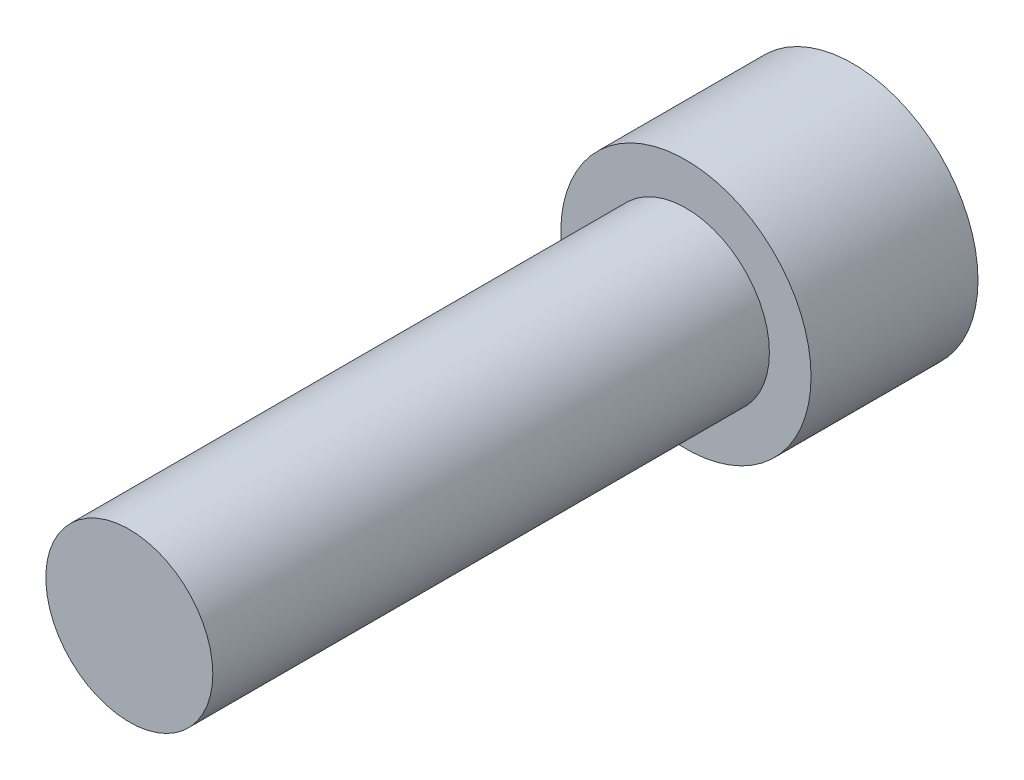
ISO-10303-21;
HEADER;
FILE_DESCRIPTION(('STEP AP214'),'2;1');
FILE_NAME('part.step','',(''),(''),'','','');
FILE_SCHEMA(('AUTOMOTIVE_DESIGN { 1 0 10303 214 1 1 1 1 }'));
ENDSEC;
DATA;
#1=APPLICATION_CONTEXT('core data for automotive mechanical design processes');
#2=APPLICATION_PROTOCOL_DEFINITION('international standard','automotive_design',2000,#1);
#3=PRODUCT_CONTEXT('',#1,'mechanical');
#4=PRODUCT('Part','Part','',(#3));
#5=PRODUCT_RELATED_PRODUCT_CATEGORY('part','',(#4));
#6=PRODUCT_DEFINITION_FORMATION('','',#4);
#7=PRODUCT_DEFINITION_CONTEXT('part definition',#1,'design');
#8=PRODUCT_DEFINITION('design','',#6,#7);
#9=PRODUCT_DEFINITION_SHAPE('','',#8);
#10=(LENGTH_UNIT() NAMED_UNIT(*) SI_UNIT(.MILLI.,.METRE.));
#11=(NAMED_UNIT(*) PLANE_ANGLE_UNIT() SI_UNIT($,.RADIAN.));
#12=(NAMED_UNIT(*) SI_UNIT($,.STERADIAN.) SOLID_ANGLE_UNIT());
#13=UNCERTAINTY_MEASURE_WITH_UNIT(LENGTH_MEASURE(1.E-05),#10,'distance_accuracy_value','');
#14=(GEOMETRIC_REPRESENTATION_CONTEXT(3) GLOBAL_UNCERTAINTY_ASSIGNED_CONTEXT((#13)) GLOBAL_UNIT_ASSIGNED_CONTEXT((#10,
#11,#12)) REPRESENTATION_CONTEXT('',''));
#15=CARTESIAN_POINT('',(0.,0.,0.));
#16=DIRECTION('',(0.,0.,1.));
#17=DIRECTION('',(1.,0.,0.));
#18=AXIS2_PLACEMENT_3D('',#15,#16,#17);
#19=CARTESIAN_POINT('',(0.,0.,31.75));
#20=DIRECTION('',(0.,0.,1.));
#21=DIRECTION('',(1.,0.,0.));
#22=AXIS2_PLACEMENT_3D('',#19,#20,#21);
#23=PLANE('',#22);
#24=CARTESIAN_POINT('',(0.,0.,31.75));
#25=DIRECTION('',(0.,0.,1.));
#26=DIRECTION('',(1.,0.,0.));
#27=AXIS2_PLACEMENT_3D('',#24,#25,#26);
#28=CIRCLE('',#27,4.7625);
#29=CARTESIAN_POINT('',(4.7625,0.,31.75));
#30=VERTEX_POINT('',#29);
#31=EDGE_CURVE('E11',#30,#30,#28,.T.);
#32=ORIENTED_EDGE('',*,*,#31,.T.);
#33=EDGE_LOOP('',(#32));
#34=FACE_BOUND('',#33,.T.);
#35=ADVANCED_FACE('F37',(#34),#23,.T.);
#36=CARTESIAN_POINT('',(0.,0.,31.75));
#37=DIRECTION('',(0.,0.,1.));
#38=DIRECTION('',(1.,0.,0.));
#39=AXIS2_PLACEMENT_3D('',#36,#37,#38);
#40=CYLINDRICAL_SURFACE('',#39,4.7625);
#41=CARTESIAN_POINT('',(0.,0.,0.));
#42=DIRECTION('',(0.,0.,1.));
#43=DIRECTION('',(1.,0.,0.));
#44=AXIS2_PLACEMENT_3D('',#41,#42,#43);
#45=CIRCLE('',#44,4.7625);
#46=CARTESIAN_POINT('',(4.7625,0.,0.));
#47=VERTEX_POINT('',#46);
#48=EDGE_CURVE('E44',#47,#47,#45,.T.);
#49=ORIENTED_EDGE('',*,*,#48,.T.);
#50=EDGE_LOOP('',(#49));
#51=FACE_BOUND('',#50,.T.);
#52=ORIENTED_EDGE('',*,*,#31,.F.);
#53=EDGE_LOOP('',(#52));
#54=FACE_BOUND('',#53,.T.);
#55=ADVANCED_FACE('F151',(#51,#54),#40,.T.);
#56=CARTESIAN_POINT('',(0.,-4.7625,0.));
#57=DIRECTION('',(0.,0.,1.));
#58=DIRECTION('',(1.,0.,0.));
#59=AXIS2_PLACEMENT_3D('',#56,#57,#58);
#60=PLANE('',#59);
#61=CARTESIAN_POINT('',(0.,0.,0.));
#62=DIRECTION('',(0.,0.,1.));
#63=DIRECTION('',(1.,0.,0.));
#64=AXIS2_PLACEMENT_3D('',#61,#62,#63);
#65=CIRCLE('',#64,7.1374);
#66=CARTESIAN_POINT('',(7.1374,0.,0.));
#67=VERTEX_POINT('',#66);
#68=EDGE_CURVE('E146',#67,#67,#65,.T.);
#69=ORIENTED_EDGE('',*,*,#68,.T.);
#70=EDGE_LOOP('',(#69));
#71=FACE_BOUND('',#70,.T.);
#72=ORIENTED_EDGE('',*,*,#48,.F.);
#73=EDGE_LOOP('',(#72));
#74=FACE_BOUND('',#73,.T.);
#75=ADVANCED_FACE('F154',(#71,#74),#60,.T.);
#76=CARTESIAN_POINT('',(0.,0.,31.75));
#77=DIRECTION('',(0.,0.,1.));
#78=DIRECTION('',(1.,0.,0.));
#79=AXIS2_PLACEMENT_3D('',#76,#77,#78);
#80=CYLINDRICAL_SURFACE('',#79,7.1374);
#81=CARTESIAN_POINT('',(0.,0.,-9.525));
#82=DIRECTION('',(0.,0.,1.));
#83=DIRECTION('',(1.,0.,0.));
#84=AXIS2_PLACEMENT_3D('',#81,#82,#83);
#85=CIRCLE('',#84,7.1374);
#86=CARTESIAN_POINT('',(7.1374,0.,-9.525));
#87=VERTEX_POINT('',#86);
#88=EDGE_CURVE('E138',#87,#87,#85,.T.);
#89=ORIENTED_EDGE('',*,*,#88,.T.);
#90=EDGE_LOOP('',(#89));
#91=FACE_BOUND('',#90,.T.);
#92=ORIENTED_EDGE('',*,*,#68,.F.);
#93=EDGE_LOOP('',(#92));
#94=FACE_BOUND('',#93,.T.);
#95=ADVANCED_FACE('F156',(#91,#94),#80,.T.);
#96=CARTESIAN_POINT('',(0.,-7.1374,-9.525));
#97=DIRECTION('',(0.,0.,-1.));
#98=DIRECTION('',(-1.,0.,0.));
#99=AXIS2_PLACEMENT_3D('',#96,#97,#98);
#100=PLANE('',#99);
#101=DIRECTION('',(0.866025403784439,-0.5,0.));
#102=VECTOR('',#101,1.);
#103=CARTESIAN_POINT('',(0.,4.57538541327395,-9.525));
#104=LINE('',#103,#102);
#105=CARTESIAN_POINT('',(0.,4.57538541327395,-9.525));
#106=VERTEX_POINT('',#105);
#107=CARTESIAN_POINT('',(3.9624,2.28769270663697,-9.525));
#108=VERTEX_POINT('',#107);
#109=EDGE_CURVE('E51',#106,#108,#104,.T.);
#110=ORIENTED_EDGE('',*,*,#109,.F.);
#111=DIRECTION('',(0.866025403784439,0.5,0.));
#112=VECTOR('',#111,1.);
#113=CARTESIAN_POINT('',(-3.9624,2.28769270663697,-9.525));
#114=LINE('',#113,#112);
#115=CARTESIAN_POINT('',(-3.9624,2.28769270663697,-9.525));
#116=VERTEX_POINT('',#115);
#117=EDGE_CURVE('E134',#116,#106,#114,.T.);
#118=ORIENTED_EDGE('',*,*,#117,.F.);
#119=DIRECTION('',(0.,1.,0.));
#120=VECTOR('',#119,1.);
#121=CARTESIAN_POINT('',(-3.9624,-2.28769270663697,-9.525));
#122=LINE('',#121,#120);
#123=CARTESIAN_POINT('',(-3.9624,-2.28769270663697,-9.525));
#124=VERTEX_POINT('',#123);
#125=EDGE_CURVE('E132',#124,#116,#122,.T.);
#126=ORIENTED_EDGE('',*,*,#125,.F.);
#127=DIRECTION('',(-0.866025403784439,0.5,0.));
#128=VECTOR('',#127,1.);
#129=CARTESIAN_POINT('',(0.,-4.57538541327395,-9.525));
#130=LINE('',#129,#128);
#131=CARTESIAN_POINT('',(0.,-4.57538541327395,-9.525));
#132=VERTEX_POINT('',#131);
#133=EDGE_CURVE('E99',#132,#124,#130,.T.);
#134=ORIENTED_EDGE('',*,*,#133,.F.);
#135=DIRECTION('',(-0.866025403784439,-0.5,0.));
#136=VECTOR('',#135,1.);
#137=CARTESIAN_POINT('',(3.9624,-2.28769270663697,-9.525));
#138=LINE('',#137,#136);
#139=CARTESIAN_POINT('',(3.9624,-2.28769270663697,-9.525));
#140=VERTEX_POINT('',#139);
#141=EDGE_CURVE('E128',#140,#132,#138,.T.);
#142=ORIENTED_EDGE('',*,*,#141,.F.);
#143=DIRECTION('',(0.,-1.,0.));
#144=VECTOR('',#143,1.);
#145=CARTESIAN_POINT('',(3.9624,2.28769270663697,-9.525));
#146=LINE('',#145,#144);
#147=EDGE_CURVE('E125',#108,#140,#146,.T.);
#148=ORIENTED_EDGE('',*,*,#147,.F.);
#149=EDGE_LOOP('',(#110,#118,#126,#134,#142,#148));
#150=FACE_BOUND('',#149,.T.);
#151=ORIENTED_EDGE('',*,*,#88,.F.);
#152=EDGE_LOOP('',(#151));
#153=FACE_BOUND('',#152,.T.);
#154=ADVANCED_FACE('F163',(#150,#153),#100,.T.);
#155=CARTESIAN_POINT('',(0.,4.57538541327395,-3.683));
#156=DIRECTION('',(0.5,0.866025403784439,0.));
#157=DIRECTION('',(-0.866025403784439,0.5,0.));
#158=AXIS2_PLACEMENT_3D('',#155,#156,#157);
#159=PLANE('',#158);
#160=ORIENTED_EDGE('',*,*,#109,.T.);
#161=DIRECTION('',(0.,0.,-1.));
#162=VECTOR('',#161,1.);
#163=CARTESIAN_POINT('',(3.9624,2.28769270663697,-3.683));
#164=LINE('',#163,#162);
#165=CARTESIAN_POINT('',(3.9624,2.28769270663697,-3.683));
#166=VERTEX_POINT('',#165);
#167=EDGE_CURVE('E81',#166,#108,#164,.T.);
#168=ORIENTED_EDGE('',*,*,#167,.F.);
#169=DIRECTION('',(0.866025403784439,-0.5,0.));
#170=VECTOR('',#169,1.);
#171=CARTESIAN_POINT('',(0.,4.57538541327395,-3.683));
#172=LINE('',#171,#170);
#173=CARTESIAN_POINT('',(0.,4.57538541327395,-3.683));
#174=VERTEX_POINT('',#173);
#175=EDGE_CURVE('E136',#174,#166,#172,.T.);
#176=ORIENTED_EDGE('',*,*,#175,.F.);
#177=DIRECTION('',(0.,0.,-1.));
#178=VECTOR('',#177,1.);
#179=CARTESIAN_POINT('',(0.,4.57538541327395,-3.683));
#180=LINE('',#179,#178);
#181=EDGE_CURVE('E59',#174,#106,#180,.T.);
#182=ORIENTED_EDGE('',*,*,#181,.T.);
#183=EDGE_LOOP('',(#160,#168,#176,#182));
#184=FACE_BOUND('',#183,.T.);
#185=ADVANCED_FACE('F197',(#184),#159,.F.);
#186=CARTESIAN_POINT('',(-3.9624,2.28769270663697,-3.683));
#187=DIRECTION('',(-0.5,0.866025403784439,0.));
#188=DIRECTION('',(-0.866025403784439,-0.5,0.));
#189=AXIS2_PLACEMENT_3D('',#186,#187,#188);
#190=PLANE('',#189);
#191=ORIENTED_EDGE('',*,*,#117,.T.);
#192=ORIENTED_EDGE('',*,*,#181,.F.);
#193=DIRECTION('',(0.866025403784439,0.5,0.));
#194=VECTOR('',#193,1.);
#195=CARTESIAN_POINT('',(-3.9624,2.28769270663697,-3.683));
#196=LINE('',#195,#194);
#197=CARTESIAN_POINT('',(-3.9624,2.28769270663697,-3.683));
#198=VERTEX_POINT('',#197);
#199=EDGE_CURVE('E111',#198,#174,#196,.T.);
#200=ORIENTED_EDGE('',*,*,#199,.F.);
#201=DIRECTION('',(0.,0.,-1.));
#202=VECTOR('',#201,1.);
#203=CARTESIAN_POINT('',(-3.9624,2.28769270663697,-3.683));
#204=LINE('',#203,#202);
#205=EDGE_CURVE('E103',#198,#116,#204,.T.);
#206=ORIENTED_EDGE('',*,*,#205,.T.);
#207=EDGE_LOOP('',(#191,#192,#200,#206));
#208=FACE_BOUND('',#207,.T.);
#209=ADVANCED_FACE('F208',(#208),#190,.F.);
#210=CARTESIAN_POINT('',(-3.9624,-2.28769270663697,-3.683));
#211=DIRECTION('',(-1.,0.,0.));
#212=DIRECTION('',(0.,0.,1.));
#213=AXIS2_PLACEMENT_3D('',#210,#211,#212);
#214=PLANE('',#213);
#215=ORIENTED_EDGE('',*,*,#125,.T.);
#216=ORIENTED_EDGE('',*,*,#205,.F.);
#217=DIRECTION('',(0.,1.,0.));
#218=VECTOR('',#217,1.);
#219=CARTESIAN_POINT('',(-3.9624,-2.28769270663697,-3.683));
#220=LINE('',#219,#218);
#221=CARTESIAN_POINT('',(-3.9624,-2.28769270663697,-3.683));
#222=VERTEX_POINT('',#221);
#223=EDGE_CURVE('E107',#222,#198,#220,.T.);
#224=ORIENTED_EDGE('',*,*,#223,.F.);
#225=DIRECTION('',(0.,0.,-1.));
#226=VECTOR('',#225,1.);
#227=CARTESIAN_POINT('',(-3.9624,-2.28769270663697,-3.683));
#228=LINE('',#227,#226);
#229=EDGE_CURVE('E92',#222,#124,#228,.T.);
#230=ORIENTED_EDGE('',*,*,#229,.T.);
#231=EDGE_LOOP('',(#215,#216,#224,#230));
#232=FACE_BOUND('',#231,.T.);
#233=ADVANCED_FACE('F108',(#232),#214,.F.);
#234=CARTESIAN_POINT('',(0.,-4.57538541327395,-3.683));
#235=DIRECTION('',(-0.5,-0.866025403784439,0.));
#236=DIRECTION('',(0.866025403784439,-0.5,0.));
#237=AXIS2_PLACEMENT_3D('',#234,#235,#236);
#238=PLANE('',#237);
#239=ORIENTED_EDGE('',*,*,#133,.T.);
#240=ORIENTED_EDGE('',*,*,#229,.F.);
#241=DIRECTION('',(-0.866025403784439,0.5,0.));
#242=VECTOR('',#241,1.);
#243=CARTESIAN_POINT('',(0.,-4.57538541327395,-3.683));
#244=LINE('',#243,#242);
#245=CARTESIAN_POINT('',(0.,-4.57538541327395,-3.683));
#246=VERTEX_POINT('',#245);
#247=EDGE_CURVE('E96',#246,#222,#244,.T.);
#248=ORIENTED_EDGE('',*,*,#247,.F.);
#249=DIRECTION('',(0.,0.,-1.));
#250=VECTOR('',#249,1.);
#251=CARTESIAN_POINT('',(0.,-4.57538541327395,-3.683));
#252=LINE('',#251,#250);
#253=EDGE_CURVE('E104',#246,#132,#252,.T.);
#254=ORIENTED_EDGE('',*,*,#253,.T.);
#255=EDGE_LOOP('',(#239,#240,#248,#254));
#256=FACE_BOUND('',#255,.T.);
#257=ADVANCED_FACE('F94',(#256),#238,.F.);
#258=CARTESIAN_POINT('',(3.9624,-2.28769270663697,-3.683));
#259=DIRECTION('',(0.5,-0.866025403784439,0.));
#260=DIRECTION('',(0.866025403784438,0.5,0.));
#261=AXIS2_PLACEMENT_3D('',#258,#259,#260);
#262=PLANE('',#261);
#263=ORIENTED_EDGE('',*,*,#141,.T.);
#264=ORIENTED_EDGE('',*,*,#253,.F.);
#265=DIRECTION('',(-0.866025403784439,-0.5,0.));
#266=VECTOR('',#265,1.);
#267=CARTESIAN_POINT('',(3.9624,-2.28769270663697,-3.683));
#268=LINE('',#267,#266);
#269=CARTESIAN_POINT('',(3.9624,-2.28769270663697,-3.683));
#270=VERTEX_POINT('',#269);
#271=EDGE_CURVE('E117',#270,#246,#268,.T.);
#272=ORIENTED_EDGE('',*,*,#271,.F.);
#273=DIRECTION('',(0.,0.,-1.));
#274=VECTOR('',#273,1.);
#275=CARTESIAN_POINT('',(3.9624,-2.28769270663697,-3.683));
#276=LINE('',#275,#274);
#277=EDGE_CURVE('E141',#270,#140,#276,.T.);
#278=ORIENTED_EDGE('',*,*,#277,.T.);
#279=EDGE_LOOP('',(#263,#264,#272,#278));
#280=FACE_BOUND('',#279,.T.);
#281=ADVANCED_FACE('F236',(#280),#262,.F.);
#282=CARTESIAN_POINT('',(3.9624,2.28769270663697,-3.683));
#283=DIRECTION('',(1.,0.,0.));
#284=DIRECTION('',(0.,0.,-1.));
#285=AXIS2_PLACEMENT_3D('',#282,#283,#284);
#286=PLANE('',#285);
#287=ORIENTED_EDGE('',*,*,#147,.T.);
#288=ORIENTED_EDGE('',*,*,#277,.F.);
#289=DIRECTION('',(0.,-1.,0.));
#290=VECTOR('',#289,1.);
#291=CARTESIAN_POINT('',(3.9624,2.28769270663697,-3.683));
#292=LINE('',#291,#290);
#293=EDGE_CURVE('E119',#166,#270,#292,.T.);
#294=ORIENTED_EDGE('',*,*,#293,.F.);
#295=ORIENTED_EDGE('',*,*,#167,.T.);
#296=EDGE_LOOP('',(#287,#288,#294,#295));
#297=FACE_BOUND('',#296,.T.);
#298=ADVANCED_FACE('F246',(#297),#286,.F.);
#299=CARTESIAN_POINT('',(7.9248,0.,-3.683));
#300=DIRECTION('',(0.,0.,-1.));
#301=DIRECTION('',(-1.,0.,0.));
#302=AXIS2_PLACEMENT_3D('',#299,#300,#301);
#303=PLANE('',#302);
#304=ORIENTED_EDGE('',*,*,#175,.T.);
#305=ORIENTED_EDGE('',*,*,#293,.T.);
#306=ORIENTED_EDGE('',*,*,#271,.T.);
#307=ORIENTED_EDGE('',*,*,#247,.T.);
#308=ORIENTED_EDGE('',*,*,#223,.T.);
#309=ORIENTED_EDGE('',*,*,#199,.T.);
#310=EDGE_LOOP('',(#304,#305,#306,#307,#308,#309));
#311=FACE_BOUND('',#310,.T.);
#312=ADVANCED_FACE('F114',(#311),#303,.T.);
#313=CLOSED_SHELL('',(#35,#55,#75,#95,#154,#185,#209,#233,#257,#281,#298,#312));
#314=MANIFOLD_SOLID_BREP('B2',#313);
#315=ADVANCED_BREP_SHAPE_REPRESENTATION('',(#18,#314),#14);
#316=SHAPE_DEFINITION_REPRESENTATION(#9,#315);
ENDSEC;
END-ISO-10303-21;
